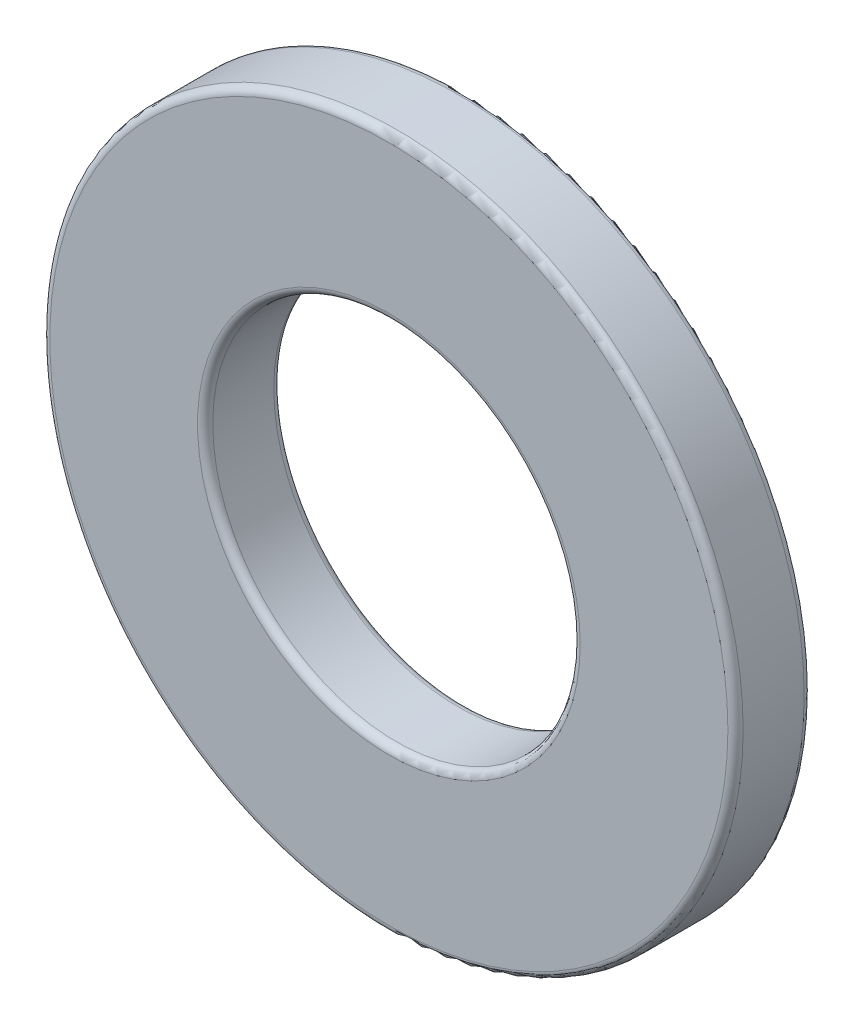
ISO-10303-21;
HEADER;
FILE_DESCRIPTION(('STEP AP214'),'2;1');
FILE_NAME('part.step','',(''),(''),'','','');
FILE_SCHEMA(('AUTOMOTIVE_DESIGN { 1 0 10303 214 1 1 1 1 }'));
ENDSEC;
DATA;
#1=APPLICATION_CONTEXT('core data for automotive mechanical design processes');
#2=APPLICATION_PROTOCOL_DEFINITION('international standard','automotive_design',2000,#1);
#3=PRODUCT_CONTEXT('',#1,'mechanical');
#4=PRODUCT('Part','Part','',(#3));
#5=PRODUCT_RELATED_PRODUCT_CATEGORY('part','',(#4));
#6=PRODUCT_DEFINITION_FORMATION('','',#4);
#7=PRODUCT_DEFINITION_CONTEXT('part definition',#1,'design');
#8=PRODUCT_DEFINITION('design','',#6,#7);
#9=PRODUCT_DEFINITION_SHAPE('','',#8);
#10=(LENGTH_UNIT() NAMED_UNIT(*) SI_UNIT(.MILLI.,.METRE.));
#11=(NAMED_UNIT(*) PLANE_ANGLE_UNIT() SI_UNIT($,.RADIAN.));
#12=(NAMED_UNIT(*) SI_UNIT($,.STERADIAN.) SOLID_ANGLE_UNIT());
#13=UNCERTAINTY_MEASURE_WITH_UNIT(LENGTH_MEASURE(1.E-05),#10,'distance_accuracy_value','');
#14=(GEOMETRIC_REPRESENTATION_CONTEXT(3) GLOBAL_UNCERTAINTY_ASSIGNED_CONTEXT((#13)) GLOBAL_UNIT_ASSIGNED_CONTEXT((#10,
#11,#12)) REPRESENTATION_CONTEXT('',''));
#15=CARTESIAN_POINT('',(0.,0.,0.));
#16=DIRECTION('',(0.,0.,1.));
#17=DIRECTION('',(1.,0.,0.));
#18=AXIS2_PLACEMENT_3D('',#15,#16,#17);
#19=CARTESIAN_POINT('',(0.,0.,-0.549999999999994));
#20=DIRECTION('',(0.,0.,1.));
#21=DIRECTION('',(1.,0.,0.));
#22=AXIS2_PLACEMENT_3D('',#19,#20,#21);
#23=CYLINDRICAL_SURFACE('',#22,5.);
#24=CARTESIAN_POINT('',(0.,0.,-0.439999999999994));
#25=DIRECTION('',(0.,0.,1.));
#26=DIRECTION('',(1.,0.,0.));
#27=AXIS2_PLACEMENT_3D('',#24,#25,#26);
#28=CIRCLE('',#27,5.);
#29=CARTESIAN_POINT('',(5.,0.,-0.439999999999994));
#30=VERTEX_POINT('',#29);
#31=EDGE_CURVE('E61',#30,#30,#28,.T.);
#32=ORIENTED_EDGE('',*,*,#31,.T.);
#33=EDGE_LOOP('',(#32));
#34=FACE_BOUND('',#33,.T.);
#35=CARTESIAN_POINT('',(0.,0.,0.440000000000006));
#36=DIRECTION('',(0.,0.,1.));
#37=DIRECTION('',(1.,0.,0.));
#38=AXIS2_PLACEMENT_3D('',#35,#36,#37);
#39=CIRCLE('',#38,5.);
#40=CARTESIAN_POINT('',(5.,0.,0.440000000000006));
#41=VERTEX_POINT('',#40);
#42=EDGE_CURVE('E64',#41,#41,#39,.F.);
#43=ORIENTED_EDGE('',*,*,#42,.T.);
#44=EDGE_LOOP('',(#43));
#45=FACE_BOUND('',#44,.T.);
#46=ADVANCED_FACE('F35',(#34,#45),#23,.T.);
#47=CARTESIAN_POINT('',(0.,0.,-0.549999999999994));
#48=DIRECTION('',(0.,0.,1.));
#49=DIRECTION('',(1.,0.,0.));
#50=AXIS2_PLACEMENT_3D('',#47,#48,#49);
#51=PLANE('',#50);
#52=CARTESIAN_POINT('',(0.,0.,-0.549999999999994));
#53=DIRECTION('',(0.,0.,1.));
#54=DIRECTION('',(1.,0.,0.));
#55=AXIS2_PLACEMENT_3D('',#52,#53,#54);
#56=CIRCLE('',#55,4.89);
#57=CARTESIAN_POINT('',(4.89,0.,-0.549999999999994));
#58=VERTEX_POINT('',#57);
#59=EDGE_CURVE('E55',#58,#58,#56,.F.);
#60=ORIENTED_EDGE('',*,*,#59,.T.);
#61=EDGE_LOOP('',(#60));
#62=FACE_BOUND('',#61,.T.);
#63=CARTESIAN_POINT('',(0.,0.,-0.549999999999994));
#64=DIRECTION('',(0.,0.,1.));
#65=DIRECTION('',(1.,0.,0.));
#66=AXIS2_PLACEMENT_3D('',#63,#64,#65);
#67=CIRCLE('',#66,2.76);
#68=CARTESIAN_POINT('',(2.76,0.,-0.549999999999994));
#69=VERTEX_POINT('',#68);
#70=EDGE_CURVE('E58',#69,#69,#67,.T.);
#71=ORIENTED_EDGE('',*,*,#70,.T.);
#72=EDGE_LOOP('',(#71));
#73=FACE_BOUND('',#72,.T.);
#74=ADVANCED_FACE('F78',(#62,#73),#51,.F.);
#75=CARTESIAN_POINT('',(0.,0.,-0.549999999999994));
#76=DIRECTION('',(0.,0.,1.));
#77=DIRECTION('',(1.,0.,0.));
#78=AXIS2_PLACEMENT_3D('',#75,#76,#77);
#79=CYLINDRICAL_SURFACE('',#78,2.65);
#80=CARTESIAN_POINT('',(0.,0.,-0.439999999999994));
#81=DIRECTION('',(0.,0.,1.));
#82=DIRECTION('',(1.,0.,0.));
#83=AXIS2_PLACEMENT_3D('',#80,#81,#82);
#84=CIRCLE('',#83,2.65);
#85=CARTESIAN_POINT('',(2.65,0.,-0.439999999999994));
#86=VERTEX_POINT('',#85);
#87=EDGE_CURVE('E46',#86,#86,#84,.F.);
#88=ORIENTED_EDGE('',*,*,#87,.T.);
#89=EDGE_LOOP('',(#88));
#90=FACE_BOUND('',#89,.T.);
#91=CARTESIAN_POINT('',(0.,0.,0.440000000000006));
#92=DIRECTION('',(0.,0.,1.));
#93=DIRECTION('',(1.,0.,0.));
#94=AXIS2_PLACEMENT_3D('',#91,#92,#93);
#95=CIRCLE('',#94,2.65);
#96=CARTESIAN_POINT('',(2.65,0.,0.440000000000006));
#97=VERTEX_POINT('',#96);
#98=EDGE_CURVE('E50',#97,#97,#95,.T.);
#99=ORIENTED_EDGE('',*,*,#98,.T.);
#100=EDGE_LOOP('',(#99));
#101=FACE_BOUND('',#100,.T.);
#102=ADVANCED_FACE('F84',(#90,#101),#79,.F.);
#103=CARTESIAN_POINT('',(0.,0.,0.550000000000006));
#104=DIRECTION('',(0.,0.,1.));
#105=DIRECTION('',(1.,0.,0.));
#106=AXIS2_PLACEMENT_3D('',#103,#104,#105);
#107=PLANE('',#106);
#108=CARTESIAN_POINT('',(0.,0.,0.550000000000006));
#109=DIRECTION('',(0.,0.,1.));
#110=DIRECTION('',(1.,0.,0.));
#111=AXIS2_PLACEMENT_3D('',#108,#109,#110);
#112=CIRCLE('',#111,2.76);
#113=CARTESIAN_POINT('',(2.76,0.,0.550000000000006));
#114=VERTEX_POINT('',#113);
#115=EDGE_CURVE('E10',#114,#114,#112,.F.);
#116=ORIENTED_EDGE('',*,*,#115,.T.);
#117=EDGE_LOOP('',(#116));
#118=FACE_BOUND('',#117,.T.);
#119=CARTESIAN_POINT('',(0.,0.,0.550000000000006));
#120=DIRECTION('',(0.,0.,1.));
#121=DIRECTION('',(1.,0.,0.));
#122=AXIS2_PLACEMENT_3D('',#119,#120,#121);
#123=CIRCLE('',#122,4.89);
#124=CARTESIAN_POINT('',(4.89,0.,0.550000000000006));
#125=VERTEX_POINT('',#124);
#126=EDGE_CURVE('E42',#125,#125,#123,.T.);
#127=ORIENTED_EDGE('',*,*,#126,.T.);
#128=EDGE_LOOP('',(#127));
#129=FACE_BOUND('',#128,.T.);
#130=ADVANCED_FACE('F92',(#118,#129),#107,.T.);
#131=CARTESIAN_POINT('',(0.,0.,-0.439999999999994));
#132=DIRECTION('',(0.,0.,1.));
#133=DIRECTION('',(1.,0.,0.));
#134=AXIS2_PLACEMENT_3D('',#131,#132,#133);
#135=TOROIDAL_SURFACE('',#134,4.89,0.11);
#136=ORIENTED_EDGE('',*,*,#59,.F.);
#137=EDGE_LOOP('',(#136));
#138=FACE_BOUND('',#137,.T.);
#139=ORIENTED_EDGE('',*,*,#31,.F.);
#140=EDGE_LOOP('',(#139));
#141=FACE_BOUND('',#140,.T.);
#142=ADVANCED_FACE('F89',(#138,#141),#135,.T.);
#143=CARTESIAN_POINT('',(0.,0.,-0.439999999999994));
#144=DIRECTION('',(0.,0.,1.));
#145=DIRECTION('',(1.,0.,0.));
#146=AXIS2_PLACEMENT_3D('',#143,#144,#145);
#147=TOROIDAL_SURFACE('',#146,2.76,0.11);
#148=ORIENTED_EDGE('',*,*,#87,.F.);
#149=EDGE_LOOP('',(#148));
#150=FACE_BOUND('',#149,.T.);
#151=ORIENTED_EDGE('',*,*,#70,.F.);
#152=EDGE_LOOP('',(#151));
#153=FACE_BOUND('',#152,.T.);
#154=ADVANCED_FACE('F75',(#150,#153),#147,.T.);
#155=CARTESIAN_POINT('',(0.,0.,0.440000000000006));
#156=DIRECTION('',(0.,0.,1.));
#157=DIRECTION('',(1.,0.,0.));
#158=AXIS2_PLACEMENT_3D('',#155,#156,#157);
#159=TOROIDAL_SURFACE('',#158,2.76,0.11);
#160=ORIENTED_EDGE('',*,*,#115,.F.);
#161=EDGE_LOOP('',(#160));
#162=FACE_BOUND('',#161,.T.);
#163=ORIENTED_EDGE('',*,*,#98,.F.);
#164=EDGE_LOOP('',(#163));
#165=FACE_BOUND('',#164,.T.);
#166=ADVANCED_FACE('F71',(#162,#165),#159,.T.);
#167=CARTESIAN_POINT('',(0.,0.,0.440000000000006));
#168=DIRECTION('',(0.,0.,1.));
#169=DIRECTION('',(1.,0.,0.));
#170=AXIS2_PLACEMENT_3D('',#167,#168,#169);
#171=TOROIDAL_SURFACE('',#170,4.89,0.11);
#172=ORIENTED_EDGE('',*,*,#42,.F.);
#173=EDGE_LOOP('',(#172));
#174=FACE_BOUND('',#173,.T.);
#175=ORIENTED_EDGE('',*,*,#126,.F.);
#176=EDGE_LOOP('',(#175));
#177=FACE_BOUND('',#176,.T.);
#178=ADVANCED_FACE('F37',(#174,#177),#171,.T.);
#179=CLOSED_SHELL('',(#46,#74,#102,#130,#142,#154,#166,#178));
#180=MANIFOLD_SOLID_BREP('B2',#179);
#181=ADVANCED_BREP_SHAPE_REPRESENTATION('',(#18,#180),#14);
#182=SHAPE_DEFINITION_REPRESENTATION(#9,#181);
ENDSEC;
END-ISO-10303-21;
